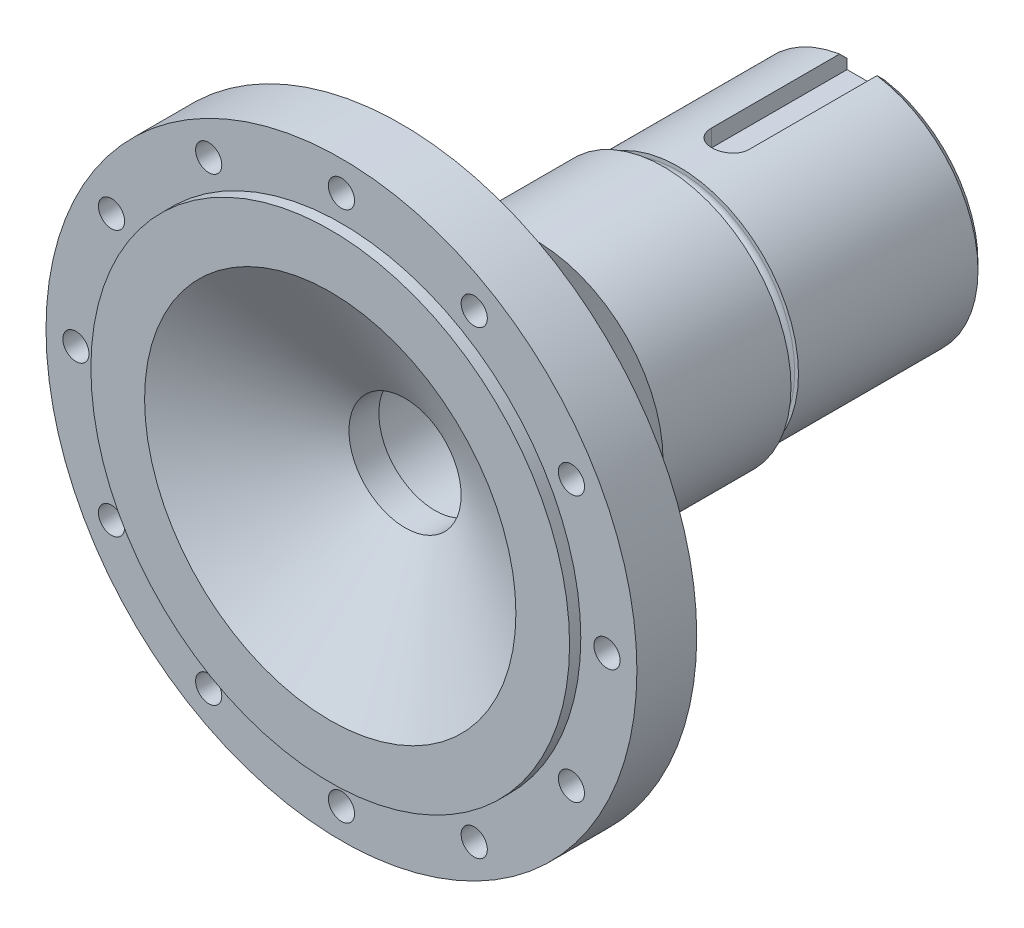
ISO-10303-21;
HEADER;
FILE_DESCRIPTION(('STEP AP214'),'2;1');
FILE_NAME('part.step','',(''),(''),'','','');
FILE_SCHEMA(('AUTOMOTIVE_DESIGN { 1 0 10303 214 1 1 1 1 }'));
ENDSEC;
DATA;
#1=APPLICATION_CONTEXT('core data for automotive mechanical design processes');
#2=APPLICATION_PROTOCOL_DEFINITION('international standard','automotive_design',2000,#1);
#3=PRODUCT_CONTEXT('',#1,'mechanical');
#4=PRODUCT('Part','Part','',(#3));
#5=PRODUCT_RELATED_PRODUCT_CATEGORY('part','',(#4));
#6=PRODUCT_DEFINITION_FORMATION('','',#4);
#7=PRODUCT_DEFINITION_CONTEXT('part definition',#1,'design');
#8=PRODUCT_DEFINITION('design','',#6,#7);
#9=PRODUCT_DEFINITION_SHAPE('','',#8);
#10=(LENGTH_UNIT() NAMED_UNIT(*) SI_UNIT(.MILLI.,.METRE.));
#11=(NAMED_UNIT(*) PLANE_ANGLE_UNIT() SI_UNIT($,.RADIAN.));
#12=(NAMED_UNIT(*) SI_UNIT($,.STERADIAN.) SOLID_ANGLE_UNIT());
#13=UNCERTAINTY_MEASURE_WITH_UNIT(LENGTH_MEASURE(1.E-05),#10,'distance_accuracy_value','');
#14=(GEOMETRIC_REPRESENTATION_CONTEXT(3) GLOBAL_UNCERTAINTY_ASSIGNED_CONTEXT((#13)) GLOBAL_UNIT_ASSIGNED_CONTEXT((#10,
#11,#12)) REPRESENTATION_CONTEXT('',''));
#15=CARTESIAN_POINT('',(0.,0.,0.));
#16=DIRECTION('',(0.,0.,1.));
#17=DIRECTION('',(1.,0.,0.));
#18=AXIS2_PLACEMENT_3D('',#15,#16,#17);
#19=CARTESIAN_POINT('',(0.,7.91257488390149,-72.3224093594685));
#20=DIRECTION('',(0.,0.,1.));
#21=DIRECTION('',(1.,0.,0.));
#22=AXIS2_PLACEMENT_3D('',#19,#20,#21);
#23=PLANE('',#22);
#24=CARTESIAN_POINT('',(0.,0.,-72.3224093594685));
#25=DIRECTION('',(0.,0.,1.));
#26=DIRECTION('',(1.,0.,0.));
#27=AXIS2_PLACEMENT_3D('',#24,#25,#26);
#28=CIRCLE('',#27,12.5101357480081);
#29=CARTESIAN_POINT('',(12.5101357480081,0.,-72.3224093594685));
#30=VERTEX_POINT('',#29);
#31=EDGE_CURVE('E180',#30,#30,#28,.T.);
#32=ORIENTED_EDGE('',*,*,#31,.T.);
#33=EDGE_LOOP('',(#32));
#34=FACE_BOUND('',#33,.T.);
#35=DIRECTION('',(0.,-1.,0.));
#36=VECTOR('',#35,1.);
#37=CARTESIAN_POINT('',(2.50000000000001,7.91257488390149,-72.3224093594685));
#38=LINE('',#37,#36);
#39=CARTESIAN_POINT('',(2.50000000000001,14.7901994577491,-72.3224093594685));
#40=VERTEX_POINT('',#39);
#41=CARTESIAN_POINT('',(2.50000000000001,13.5,-72.3224093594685));
#42=VERTEX_POINT('',#41);
#43=EDGE_CURVE('E106',#40,#42,#38,.T.);
#44=ORIENTED_EDGE('',*,*,#43,.F.);
#45=CARTESIAN_POINT('',(0.,0.,-72.3224093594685));
#46=DIRECTION('',(0.,0.,1.));
#47=DIRECTION('',(1.,0.,0.));
#48=AXIS2_PLACEMENT_3D('',#45,#46,#47);
#49=CIRCLE('',#48,15.);
#50=CARTESIAN_POINT('',(-2.50000000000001,14.7901994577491,-72.3224093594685));
#51=VERTEX_POINT('',#50);
#52=EDGE_CURVE('E53',#40,#51,#49,.F.);
#53=ORIENTED_EDGE('',*,*,#52,.T.);
#54=DIRECTION('',(0.,1.,0.));
#55=VECTOR('',#54,1.);
#56=CARTESIAN_POINT('',(-2.50000000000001,7.91257488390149,-72.3224093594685));
#57=LINE('',#56,#55);
#58=CARTESIAN_POINT('',(-2.50000000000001,13.5,-72.3224093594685));
#59=VERTEX_POINT('',#58);
#60=EDGE_CURVE('E100',#59,#51,#57,.T.);
#61=ORIENTED_EDGE('',*,*,#60,.F.);
#62=DIRECTION('',(-1.,0.,0.));
#63=VECTOR('',#62,1.);
#64=CARTESIAN_POINT('',(0.,13.5,-72.3224093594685));
#65=LINE('',#64,#63);
#66=EDGE_CURVE('E585',#42,#59,#65,.T.);
#67=ORIENTED_EDGE('',*,*,#66,.F.);
#68=EDGE_LOOP('',(#44,#53,#61,#67));
#69=FACE_BOUND('',#68,.T.);
#70=ADVANCED_FACE('F40',(#34,#69),#23,.F.);
#71=CARTESIAN_POINT('',(0.,0.,61.8175968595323));
#72=DIRECTION('',(0.,0.,1.));
#73=DIRECTION('',(1.,0.,0.));
#74=AXIS2_PLACEMENT_3D('',#71,#72,#73);
#75=CYLINDRICAL_SURFACE('',#74,16.);
#76=CARTESIAN_POINT('',(0.,0.,-47.3224093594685));
#77=DIRECTION('',(0.,0.,1.));
#78=DIRECTION('',(1.,0.,0.));
#79=AXIS2_PLACEMENT_3D('',#76,#77,#78);
#80=CIRCLE('',#79,16.);
#81=CARTESIAN_POINT('',(16.,0.,-47.3224093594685));
#82=VERTEX_POINT('',#81);
#83=EDGE_CURVE('E177',#82,#82,#80,.T.);
#84=ORIENTED_EDGE('',*,*,#83,.F.);
#85=EDGE_LOOP('',(#84));
#86=FACE_BOUND('',#85,.T.);
#87=DIRECTION('',(0.,0.,1.));
#88=VECTOR('',#87,1.);
#89=CARTESIAN_POINT('',(-2.5,15.8034806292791,61.8175968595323));
#90=LINE('',#89,#88);
#91=CARTESIAN_POINT('',(-2.50000000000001,15.8034806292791,-54.2224093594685));
#92=VERTEX_POINT('',#91);
#93=CARTESIAN_POINT('',(-2.5,15.8034806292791,-71.3224093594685));
#94=VERTEX_POINT('',#93);
#95=EDGE_CURVE('E228',#92,#94,#90,.F.);
#96=ORIENTED_EDGE('',*,*,#95,.T.);
#97=CARTESIAN_POINT('',(0.,0.,-71.3224093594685));
#98=DIRECTION('',(0.,0.,1.));
#99=DIRECTION('',(1.,0.,0.));
#100=AXIS2_PLACEMENT_3D('',#97,#98,#99);
#101=CIRCLE('',#100,16.);
#102=CARTESIAN_POINT('',(2.49999999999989,15.8034806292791,-71.3224093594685));
#103=VERTEX_POINT('',#102);
#104=EDGE_CURVE('E583',#94,#103,#101,.T.);
#105=ORIENTED_EDGE('',*,*,#104,.T.);
#106=DIRECTION('',(0.,0.,1.));
#107=VECTOR('',#106,1.);
#108=CARTESIAN_POINT('',(2.49999999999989,15.8034806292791,61.8175968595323));
#109=LINE('',#108,#107);
#110=CARTESIAN_POINT('',(2.49999999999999,15.8034806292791,-54.2224093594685));
#111=VERTEX_POINT('',#110);
#112=EDGE_CURVE('E260',#103,#111,#109,.T.);
#113=ORIENTED_EDGE('',*,*,#112,.T.);
#114=CARTESIAN_POINT('',(0.,16.,-56.7224093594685));
#115=CARTESIAN_POINT('',(0.139515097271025,15.9999977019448,-56.722403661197));
#116=CARTESIAN_POINT('',(0.279109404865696,15.9981561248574,-56.7106912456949));
#117=CARTESIAN_POINT('',(0.554391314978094,15.9909869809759,-56.6641656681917));
#118=CARTESIAN_POINT('',(0.690075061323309,15.9856560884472,-56.629330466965));
#119=CARTESIAN_POINT('',(0.953512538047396,15.9721069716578,-56.5376296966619));
#120=CARTESIAN_POINT('',(1.0812723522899,15.9638909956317,-56.4807812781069));
#121=CARTESIAN_POINT('',(1.32542125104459,15.9454779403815,-56.3467108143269));
#122=CARTESIAN_POINT('',(1.4418118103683,15.9352811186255,-56.2694914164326));
#123=CARTESIAN_POINT('',(1.66091991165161,15.9139426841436,-56.0961763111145));
#124=CARTESIAN_POINT('',(1.76352747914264,15.9027945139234,-55.9999423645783));
#125=CARTESIAN_POINT('',(1.95120768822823,15.8808607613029,-55.7916274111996));
#126=CARTESIAN_POINT('',(2.03627928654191,15.8700752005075,-55.6795454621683));
#127=CARTESIAN_POINT('',(2.18690544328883,15.8500242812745,-55.4419710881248));
#128=CARTESIAN_POINT('',(2.25235273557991,15.840767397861,-55.3164098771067));
#129=CARTESIAN_POINT('',(2.36118681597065,15.8249120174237,-55.0559079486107));
#130=CARTESIAN_POINT('',(2.40457491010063,15.8183133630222,-54.9209677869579));
#131=CARTESIAN_POINT('',(2.46771559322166,15.8085863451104,-54.6466984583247));
#132=CARTESIAN_POINT('',(2.48765705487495,15.8054302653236,-54.5074137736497));
#133=CARTESIAN_POINT('',(2.50392369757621,15.8028617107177,-54.2274421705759));
#134=CARTESIAN_POINT('',(2.50025034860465,15.8034490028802,-54.0867553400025));
#135=CARTESIAN_POINT('',(2.46954580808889,15.8082755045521,-53.8093123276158));
#136=CARTESIAN_POINT('',(2.44272562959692,15.8124817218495,-53.6725321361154));
#137=CARTESIAN_POINT('',(2.36681937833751,15.8240205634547,-53.4054373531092));
#138=CARTESIAN_POINT('',(2.31773262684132,15.8313532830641,-53.275122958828));
#139=CARTESIAN_POINT('',(2.19846916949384,15.8483550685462,-53.0240206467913));
#140=CARTESIAN_POINT('',(2.12820372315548,15.8580339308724,-52.9032755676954));
#141=CARTESIAN_POINT('',(1.96864058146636,15.878630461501,-52.675209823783));
#142=CARTESIAN_POINT('',(1.87934153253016,15.8895482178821,-52.567890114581));
#143=CARTESIAN_POINT('',(1.68309088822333,15.911537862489,-52.3684991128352));
#144=CARTESIAN_POINT('',(1.57595800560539,15.9226101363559,-52.276606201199));
#145=CARTESIAN_POINT('',(1.34769694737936,15.9435512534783,-52.1120762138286));
#146=CARTESIAN_POINT('',(1.22656870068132,15.9534200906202,-52.0394392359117));
#147=CARTESIAN_POINT('',(0.973595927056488,15.9708539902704,-51.9154712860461));
#148=CARTESIAN_POINT('',(0.841744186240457,15.9784174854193,-51.8641548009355));
#149=CARTESIAN_POINT('',(0.571149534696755,15.9903756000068,-51.7844433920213));
#150=CARTESIAN_POINT('',(0.432407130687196,15.9947704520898,-51.756046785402));
#151=CARTESIAN_POINT('',(0.15350833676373,15.9998651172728,-51.7232200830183));
#152=CARTESIAN_POINT('',(0.0133814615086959,16.0006027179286,-51.7185448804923));
#153=CARTESIAN_POINT('',(-0.265654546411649,15.9984028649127,-51.7326420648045));
#154=CARTESIAN_POINT('',(-0.404563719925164,15.9954655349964,-51.7514136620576));
#155=CARTESIAN_POINT('',(-0.676473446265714,15.9862692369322,-51.8116677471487));
#156=CARTESIAN_POINT('',(-0.80950126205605,15.9800278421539,-51.8530301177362));
#157=CARTESIAN_POINT('',(-1.06673406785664,15.9649207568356,-51.9571644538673));
#158=CARTESIAN_POINT('',(-1.19093861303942,15.9560549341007,-52.0199374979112));
#159=CARTESIAN_POINT('',(-1.42807220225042,15.9365897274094,-52.1656813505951));
#160=CARTESIAN_POINT('',(-1.54090512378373,15.9259772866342,-52.248806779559));
#161=CARTESIAN_POINT('',(-1.75110696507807,15.9042388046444,-52.4326814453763));
#162=CARTESIAN_POINT('',(-1.84847490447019,15.8931127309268,-52.5334317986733));
#163=CARTESIAN_POINT('',(-2.02588080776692,15.8714802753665,-52.7507905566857));
#164=CARTESIAN_POINT('',(-2.10575398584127,15.860980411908,-52.8675342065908));
#165=CARTESIAN_POINT('',(-2.24475567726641,15.8419069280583,-53.1129254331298));
#166=CARTESIAN_POINT('',(-2.30388478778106,15.83333325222,-53.241572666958));
#167=CARTESIAN_POINT('',(-2.39946771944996,15.8191307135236,-53.5066390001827));
#168=CARTESIAN_POINT('',(-2.43600654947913,15.8134908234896,-53.6430268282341));
#169=CARTESIAN_POINT('',(-2.48564122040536,15.8057657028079,-53.9200985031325));
#170=CARTESIAN_POINT('',(-2.49873883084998,15.8036802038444,-54.0607820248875));
#171=CARTESIAN_POINT('',(-2.50107452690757,15.8033105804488,-54.340808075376));
#172=CARTESIAN_POINT('',(-2.49057180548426,15.804985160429,-54.480148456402));
#173=CARTESIAN_POINT('',(-2.44656223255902,15.8118569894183,-54.7550546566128));
#174=CARTESIAN_POINT('',(-2.41305543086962,15.8170542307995,-54.8906204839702));
#175=CARTESIAN_POINT('',(-2.32408329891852,15.830370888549,-55.154047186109));
#176=CARTESIAN_POINT('',(-2.26863761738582,15.8384876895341,-55.2819148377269));
#177=CARTESIAN_POINT('',(-2.13738768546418,15.856731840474,-55.5265749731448));
#178=CARTESIAN_POINT('',(-2.06158262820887,15.8668592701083,-55.6433670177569));
#179=CARTESIAN_POINT('',(-1.89083008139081,15.8881156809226,-55.8638749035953));
#180=CARTESIAN_POINT('',(-1.79569107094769,15.8992540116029,-55.9674415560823));
#181=CARTESIAN_POINT('',(-1.58937594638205,15.9212004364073,-56.1572305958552));
#182=CARTESIAN_POINT('',(-1.47819612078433,15.9320084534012,-56.2434489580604));
#183=CARTESIAN_POINT('',(-1.24216685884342,15.952151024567,-56.3965605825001));
#184=CARTESIAN_POINT('',(-1.11723937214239,15.9614763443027,-56.4633347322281));
#185=CARTESIAN_POINT('',(-0.857851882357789,15.9775125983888,-56.5748503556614));
#186=CARTESIAN_POINT('',(-0.723401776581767,15.9842262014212,-56.6196143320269));
#187=CARTESIAN_POINT('',(-0.4903142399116,15.9927744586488,-56.6758423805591));
#188=CARTESIAN_POINT('',(-0.393105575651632,15.9954699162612,-56.6932778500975));
#189=CARTESIAN_POINT('',(-0.19727779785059,15.9990834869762,-56.7165632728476));
#190=CARTESIAN_POINT('',(-0.0986587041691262,16.0000016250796,-56.7224133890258));
#191=CARTESIAN_POINT('',(0.,16.,-56.7224093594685));
#192=B_SPLINE_CURVE_WITH_KNOTS('',3,(#114,#115,#116,#117,#118,#119,#120,#121,#122,#123,#124,
#125,#126,#127,#128,#129,#130,#131,#132,#133,#134,#135,#136,#137,#138,#139,#140,#141,#142,#143,
#144,#145,#146,#147,#148,#149,#150,#151,#152,#153,#154,#155,#156,#157,#158,#159,#160,#161,#162,
#163,#164,#165,#166,#167,#168,#169,#170,#171,#172,#173,#174,#175,#176,#177,#178,#179,#180,#181,
#182,#183,#184,#185,#186,#187,#188,#189,#190,#191),.UNSPECIFIED.,.T.,.F.,(4,2,2,2,2,2,2,2,2,2,2,
2,2,2,2,2,2,2,2,2,2,2,2,2,2,2,2,2,2,2,2,2,2,2,2,2,2,2,4),(0.,0.418184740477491,
0.836768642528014,1.25502707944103,1.6732311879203,2.094595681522,2.51598523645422,
2.9396377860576,3.36326525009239,3.78345631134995,4.20362121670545,4.6199957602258,
5.03638299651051,5.45453977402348,5.87272629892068,6.29545732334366,6.71819049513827,
7.14121043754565,7.56419931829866,7.98280854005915,8.40140366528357,8.81779444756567,
9.23420620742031,9.65388541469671,10.0735912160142,10.4970948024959,10.9205861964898,
11.3424741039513,11.764330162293,12.1815758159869,12.598820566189,13.0156924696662,
13.4325808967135,13.8538201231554,14.275156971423,14.6990230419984,15.1224548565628,
15.4181801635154,15.7139013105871),.UNSPECIFIED.);
#193=EDGE_CURVE('E99',#111,#92,#192,.T.);
#194=ORIENTED_EDGE('',*,*,#193,.T.);
#195=EDGE_LOOP('',(#96,#105,#113,#194));
#196=FACE_BOUND('',#195,.T.);
#197=ADVANCED_FACE('F262',(#86,#196),#75,.T.);
#198=CARTESIAN_POINT('',(0.,0.,61.8175968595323));
#199=DIRECTION('',(0.,0.,1.));
#200=DIRECTION('',(1.,0.,0.));
#201=AXIS2_PLACEMENT_3D('',#198,#199,#200);
#202=CYLINDRICAL_SURFACE('',#201,17.);
#203=CARTESIAN_POINT('',(0.,0.,-45.3224093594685));
#204=DIRECTION('',(0.,0.,1.));
#205=DIRECTION('',(1.,0.,0.));
#206=AXIS2_PLACEMENT_3D('',#203,#204,#205);
#207=CIRCLE('',#206,17.);
#208=CARTESIAN_POINT('',(17.,0.,-45.3224093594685));
#209=VERTEX_POINT('',#208);
#210=EDGE_CURVE('E168',#209,#209,#207,.T.);
#211=ORIENTED_EDGE('',*,*,#210,.T.);
#212=EDGE_LOOP('',(#211));
#213=FACE_BOUND('',#212,.T.);
#214=CARTESIAN_POINT('',(0.,0.,-28.2224093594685));
#215=DIRECTION('',(0.,0.,1.));
#216=DIRECTION('',(1.,0.,0.));
#217=AXIS2_PLACEMENT_3D('',#214,#215,#216);
#218=CIRCLE('',#217,17.);
#219=CARTESIAN_POINT('',(17.,0.,-28.2224093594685));
#220=VERTEX_POINT('',#219);
#221=EDGE_CURVE('E225',#220,#220,#218,.T.);
#222=ORIENTED_EDGE('',*,*,#221,.F.);
#223=EDGE_LOOP('',(#222));
#224=FACE_BOUND('',#223,.T.);
#225=ADVANCED_FACE('F42',(#213,#224),#202,.T.);
#226=CARTESIAN_POINT('',(0.,0.,-16.7224093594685));
#227=DIRECTION('',(0.,0.,1.));
#228=DIRECTION('',(1.,0.,0.));
#229=AXIS2_PLACEMENT_3D('',#226,#227,#228);
#230=CONICAL_SURFACE('',#229,26.6496457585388,0.698131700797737);
#231=ORIENTED_EDGE('',*,*,#221,.T.);
#232=EDGE_LOOP('',(#231));
#233=FACE_BOUND('',#232,.T.);
#234=CARTESIAN_POINT('',(0.,0.,-16.7224093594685));
#235=DIRECTION('',(0.,0.,1.));
#236=DIRECTION('',(1.,0.,0.));
#237=AXIS2_PLACEMENT_3D('',#234,#235,#236);
#238=CIRCLE('',#237,26.6496457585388);
#239=CARTESIAN_POINT('',(26.6496457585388,0.,-16.7224093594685));
#240=VERTEX_POINT('',#239);
#241=EDGE_CURVE('E222',#240,#240,#238,.T.);
#242=ORIENTED_EDGE('',*,*,#241,.F.);
#243=EDGE_LOOP('',(#242));
#244=FACE_BOUND('',#243,.T.);
#245=ADVANCED_FACE('F395',(#233,#244),#230,.T.);
#246=CARTESIAN_POINT('',(0.,7.91257488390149,-16.7224093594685));
#247=DIRECTION('',(0.,0.,1.));
#248=DIRECTION('',(1.,0.,0.));
#249=AXIS2_PLACEMENT_3D('',#246,#247,#248);
#250=PLANE('',#249);
#251=CARTESIAN_POINT('',(0.,0.,-16.7224093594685));
#252=DIRECTION('',(0.,0.,1.));
#253=DIRECTION('',(1.,0.,0.));
#254=AXIS2_PLACEMENT_3D('',#251,#252,#253);
#255=CIRCLE('',#254,28.);
#256=CARTESIAN_POINT('',(28.,0.,-16.7224093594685));
#257=VERTEX_POINT('',#256);
#258=EDGE_CURVE('E219',#257,#257,#255,.T.);
#259=ORIENTED_EDGE('',*,*,#258,.F.);
#260=EDGE_LOOP('',(#259));
#261=FACE_BOUND('',#260,.T.);
#262=ORIENTED_EDGE('',*,*,#241,.T.);
#263=EDGE_LOOP('',(#262));
#264=FACE_BOUND('',#263,.T.);
#265=ADVANCED_FACE('F392',(#261,#264),#250,.F.);
#266=CARTESIAN_POINT('',(0.,0.,61.8175968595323));
#267=DIRECTION('',(0.,0.,1.));
#268=DIRECTION('',(1.,0.,0.));
#269=AXIS2_PLACEMENT_3D('',#266,#267,#268);
#270=CYLINDRICAL_SURFACE('',#269,28.);
#271=ORIENTED_EDGE('',*,*,#258,.T.);
#272=EDGE_LOOP('',(#271));
#273=FACE_BOUND('',#272,.T.);
#274=CARTESIAN_POINT('',(0.,0.,-10.2224093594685));
#275=DIRECTION('',(0.,0.,1.));
#276=DIRECTION('',(1.,0.,0.));
#277=AXIS2_PLACEMENT_3D('',#274,#275,#276);
#278=CIRCLE('',#277,28.);
#279=CARTESIAN_POINT('',(28.,0.,-10.2224093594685));
#280=VERTEX_POINT('',#279);
#281=EDGE_CURVE('E216',#280,#280,#278,.T.);
#282=ORIENTED_EDGE('',*,*,#281,.F.);
#283=EDGE_LOOP('',(#282));
#284=FACE_BOUND('',#283,.T.);
#285=ADVANCED_FACE('F388',(#273,#284),#270,.T.);
#286=CARTESIAN_POINT('',(0.,7.91257488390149,-10.2224093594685));
#287=DIRECTION('',(0.,0.,1.));
#288=DIRECTION('',(1.,0.,0.));
#289=AXIS2_PLACEMENT_3D('',#286,#287,#288);
#290=PLANE('',#289);
#291=CARTESIAN_POINT('',(17.7499999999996,30.7439018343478,-10.2224093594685));
#292=DIRECTION('',(0.,0.,1.));
#293=DIRECTION('',(1.,0.,0.));
#294=AXIS2_PLACEMENT_3D('',#291,#292,#293);
#295=CIRCLE('',#294,1.75);
#296=CARTESIAN_POINT('',(19.4999999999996,30.7439018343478,-10.2224093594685));
#297=VERTEX_POINT('',#296);
#298=EDGE_CURVE('E121',#297,#297,#295,.T.);
#299=ORIENTED_EDGE('',*,*,#298,.T.);
#300=EDGE_LOOP('',(#299));
#301=FACE_BOUND('',#300,.T.);
#302=CARTESIAN_POINT('',(30.7439018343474,17.7500000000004,-10.2224093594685));
#303=DIRECTION('',(0.,0.,1.));
#304=DIRECTION('',(1.,0.,0.));
#305=AXIS2_PLACEMENT_3D('',#302,#303,#304);
#306=CIRCLE('',#305,1.75);
#307=CARTESIAN_POINT('',(32.4939018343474,17.7500000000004,-10.2224093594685));
#308=VERTEX_POINT('',#307);
#309=EDGE_CURVE('E125',#308,#308,#306,.T.);
#310=ORIENTED_EDGE('',*,*,#309,.T.);
#311=EDGE_LOOP('',(#310));
#312=FACE_BOUND('',#311,.T.);
#313=CARTESIAN_POINT('',(35.5,3.71842977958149E-13,-10.2224093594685));
#314=DIRECTION('',(0.,0.,1.));
#315=DIRECTION('',(1.,0.,0.));
#316=AXIS2_PLACEMENT_3D('',#313,#314,#315);
#317=CIRCLE('',#316,1.75);
#318=CARTESIAN_POINT('',(37.25,3.71842977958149E-13,-10.2224093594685));
#319=VERTEX_POINT('',#318);
#320=EDGE_CURVE('E129',#319,#319,#317,.T.);
#321=ORIENTED_EDGE('',*,*,#320,.T.);
#322=EDGE_LOOP('',(#321));
#323=FACE_BOUND('',#322,.T.);
#324=CARTESIAN_POINT('',(30.7439018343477,-17.7499999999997,-10.2224093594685));
#325=DIRECTION('',(0.,0.,1.));
#326=DIRECTION('',(1.,0.,0.));
#327=AXIS2_PLACEMENT_3D('',#324,#325,#326);
#328=CIRCLE('',#327,1.75);
#329=CARTESIAN_POINT('',(32.4939018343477,-17.7499999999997,-10.2224093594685));
#330=VERTEX_POINT('',#329);
#331=EDGE_CURVE('E133',#330,#330,#328,.T.);
#332=ORIENTED_EDGE('',*,*,#331,.T.);
#333=EDGE_LOOP('',(#332));
#334=FACE_BOUND('',#333,.T.);
#335=CARTESIAN_POINT('',(17.7500000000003,-30.7439018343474,-10.2224093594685));
#336=DIRECTION('',(0.,0.,1.));
#337=DIRECTION('',(1.,0.,0.));
#338=AXIS2_PLACEMENT_3D('',#335,#336,#337);
#339=CIRCLE('',#338,1.75);
#340=CARTESIAN_POINT('',(19.5000000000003,-30.7439018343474,-10.2224093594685));
#341=VERTEX_POINT('',#340);
#342=EDGE_CURVE('E137',#341,#341,#339,.T.);
#343=ORIENTED_EDGE('',*,*,#342,.T.);
#344=EDGE_LOOP('',(#343));
#345=FACE_BOUND('',#344,.T.);
#346=CARTESIAN_POINT('',(2.47895318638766E-13,-35.5,-10.2224093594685));
#347=DIRECTION('',(0.,0.,1.));
#348=DIRECTION('',(1.,0.,0.));
#349=AXIS2_PLACEMENT_3D('',#346,#347,#348);
#350=CIRCLE('',#349,1.75);
#351=CARTESIAN_POINT('',(1.75000000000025,-35.5,-10.2224093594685));
#352=VERTEX_POINT('',#351);
#353=EDGE_CURVE('E141',#352,#352,#350,.T.);
#354=ORIENTED_EDGE('',*,*,#353,.T.);
#355=EDGE_LOOP('',(#354));
#356=FACE_BOUND('',#355,.T.);
#357=CARTESIAN_POINT('',(-17.7499999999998,-30.7439018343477,-10.2224093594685));
#358=DIRECTION('',(0.,0.,1.));
#359=DIRECTION('',(1.,0.,0.));
#360=AXIS2_PLACEMENT_3D('',#357,#358,#359);
#361=CIRCLE('',#360,1.75);
#362=CARTESIAN_POINT('',(-15.9999999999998,-30.7439018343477,-10.2224093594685));
#363=VERTEX_POINT('',#362);
#364=EDGE_CURVE('E145',#363,#363,#361,.T.);
#365=ORIENTED_EDGE('',*,*,#364,.T.);
#366=EDGE_LOOP('',(#365));
#367=FACE_BOUND('',#366,.T.);
#368=CARTESIAN_POINT('',(-30.7439018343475,-17.7500000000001,-10.2224093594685));
#369=DIRECTION('',(0.,0.,1.));
#370=DIRECTION('',(1.,0.,0.));
#371=AXIS2_PLACEMENT_3D('',#368,#369,#370);
#372=CIRCLE('',#371,1.75);
#373=CARTESIAN_POINT('',(-28.9939018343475,-17.7500000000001,-10.2224093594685));
#374=VERTEX_POINT('',#373);
#375=EDGE_CURVE('E149',#374,#374,#372,.T.);
#376=ORIENTED_EDGE('',*,*,#375,.T.);
#377=EDGE_LOOP('',(#376));
#378=FACE_BOUND('',#377,.T.);
#379=CARTESIAN_POINT('',(-35.5,-1.23947659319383E-13,-10.2224093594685));
#380=DIRECTION('',(0.,0.,1.));
#381=DIRECTION('',(1.,0.,0.));
#382=AXIS2_PLACEMENT_3D('',#379,#380,#381);
#383=CIRCLE('',#382,1.75);
#384=CARTESIAN_POINT('',(-33.75,-1.23947659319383E-13,-10.2224093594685));
#385=VERTEX_POINT('',#384);
#386=EDGE_CURVE('E153',#385,#385,#383,.T.);
#387=ORIENTED_EDGE('',*,*,#386,.T.);
#388=EDGE_LOOP('',(#387));
#389=FACE_BOUND('',#388,.T.);
#390=CARTESIAN_POINT('',(-30.7439018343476,17.7499999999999,-10.2224093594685));
#391=DIRECTION('',(0.,0.,1.));
#392=DIRECTION('',(1.,0.,0.));
#393=AXIS2_PLACEMENT_3D('',#390,#391,#392);
#394=CIRCLE('',#393,1.75);
#395=CARTESIAN_POINT('',(-28.9939018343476,17.7499999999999,-10.2224093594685));
#396=VERTEX_POINT('',#395);
#397=EDGE_CURVE('E157',#396,#396,#394,.T.);
#398=ORIENTED_EDGE('',*,*,#397,.T.);
#399=EDGE_LOOP('',(#398));
#400=FACE_BOUND('',#399,.T.);
#401=CARTESIAN_POINT('',(-17.75,30.7439018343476,-10.2224093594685));
#402=DIRECTION('',(0.,0.,1.));
#403=DIRECTION('',(1.,0.,0.));
#404=AXIS2_PLACEMENT_3D('',#401,#402,#403);
#405=CIRCLE('',#404,1.75);
#406=CARTESIAN_POINT('',(-16.,30.7439018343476,-10.2224093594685));
#407=VERTEX_POINT('',#406);
#408=EDGE_CURVE('E161',#407,#407,#405,.T.);
#409=ORIENTED_EDGE('',*,*,#408,.T.);
#410=EDGE_LOOP('',(#409));
#411=FACE_BOUND('',#410,.T.);
#412=CARTESIAN_POINT('',(0.,35.5,-10.2224093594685));
#413=DIRECTION('',(0.,0.,1.));
#414=DIRECTION('',(1.,0.,0.));
#415=AXIS2_PLACEMENT_3D('',#412,#413,#414);
#416=CIRCLE('',#415,1.75);
#417=CARTESIAN_POINT('',(1.75,35.5,-10.2224093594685));
#418=VERTEX_POINT('',#417);
#419=EDGE_CURVE('E165',#418,#418,#416,.T.);
#420=ORIENTED_EDGE('',*,*,#419,.T.);
#421=EDGE_LOOP('',(#420));
#422=FACE_BOUND('',#421,.T.);
#423=CARTESIAN_POINT('',(0.,0.,-10.2224093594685));
#424=DIRECTION('',(0.,0.,1.));
#425=DIRECTION('',(1.,0.,0.));
#426=AXIS2_PLACEMENT_3D('',#423,#424,#425);
#427=CIRCLE('',#426,39.5);
#428=CARTESIAN_POINT('',(39.5,0.,-10.2224093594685));
#429=VERTEX_POINT('',#428);
#430=EDGE_CURVE('E213',#429,#429,#427,.T.);
#431=ORIENTED_EDGE('',*,*,#430,.F.);
#432=EDGE_LOOP('',(#431));
#433=FACE_BOUND('',#432,.T.);
#434=ORIENTED_EDGE('',*,*,#281,.T.);
#435=EDGE_LOOP('',(#434));
#436=FACE_BOUND('',#435,.T.);
#437=ADVANCED_FACE('F384',(#301,#312,#323,#334,#345,#356,#367,#378,#389,#400,#411,#422,#433,
#436),#290,.F.);
#438=CARTESIAN_POINT('',(0.,0.,61.8175968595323));
#439=DIRECTION('',(0.,0.,1.));
#440=DIRECTION('',(1.,0.,0.));
#441=AXIS2_PLACEMENT_3D('',#438,#439,#440);
#442=CYLINDRICAL_SURFACE('',#441,39.5);
#443=ORIENTED_EDGE('',*,*,#430,.T.);
#444=EDGE_LOOP('',(#443));
#445=FACE_BOUND('',#444,.T.);
#446=CARTESIAN_POINT('',(0.,0.,-2.22240935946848));
#447=DIRECTION('',(0.,0.,1.));
#448=DIRECTION('',(1.,0.,0.));
#449=AXIS2_PLACEMENT_3D('',#446,#447,#448);
#450=CIRCLE('',#449,39.5);
#451=CARTESIAN_POINT('',(39.5,0.,-2.22240935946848));
#452=VERTEX_POINT('',#451);
#453=EDGE_CURVE('E210',#452,#452,#450,.T.);
#454=ORIENTED_EDGE('',*,*,#453,.F.);
#455=EDGE_LOOP('',(#454));
#456=FACE_BOUND('',#455,.T.);
#457=ADVANCED_FACE('F380',(#445,#456),#442,.T.);
#458=CARTESIAN_POINT('',(0.,7.91257488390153,-2.22240935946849));
#459=DIRECTION('',(0.,0.,1.));
#460=DIRECTION('',(1.,0.,0.));
#461=AXIS2_PLACEMENT_3D('',#458,#459,#460);
#462=PLANE('',#461);
#463=CARTESIAN_POINT('',(17.7499999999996,30.7439018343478,-2.22240935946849));
#464=DIRECTION('',(0.,0.,1.));
#465=DIRECTION('',(1.,0.,0.));
#466=AXIS2_PLACEMENT_3D('',#463,#464,#465);
#467=CIRCLE('',#466,1.75);
#468=CARTESIAN_POINT('',(19.4999999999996,30.7439018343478,-2.22240935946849));
#469=VERTEX_POINT('',#468);
#470=EDGE_CURVE('E120',#469,#469,#467,.T.);
#471=ORIENTED_EDGE('',*,*,#470,.F.);
#472=EDGE_LOOP('',(#471));
#473=FACE_BOUND('',#472,.T.);
#474=CARTESIAN_POINT('',(30.7439018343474,17.7500000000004,-2.22240935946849));
#475=DIRECTION('',(0.,0.,1.));
#476=DIRECTION('',(1.,0.,0.));
#477=AXIS2_PLACEMENT_3D('',#474,#475,#476);
#478=CIRCLE('',#477,1.75);
#479=CARTESIAN_POINT('',(32.4939018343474,17.7500000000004,-2.22240935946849));
#480=VERTEX_POINT('',#479);
#481=EDGE_CURVE('E124',#480,#480,#478,.T.);
#482=ORIENTED_EDGE('',*,*,#481,.F.);
#483=EDGE_LOOP('',(#482));
#484=FACE_BOUND('',#483,.T.);
#485=CARTESIAN_POINT('',(35.5,3.71842977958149E-13,-2.22240935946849));
#486=DIRECTION('',(0.,0.,1.));
#487=DIRECTION('',(1.,0.,0.));
#488=AXIS2_PLACEMENT_3D('',#485,#486,#487);
#489=CIRCLE('',#488,1.75);
#490=CARTESIAN_POINT('',(37.25,3.71842977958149E-13,-2.22240935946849));
#491=VERTEX_POINT('',#490);
#492=EDGE_CURVE('E128',#491,#491,#489,.T.);
#493=ORIENTED_EDGE('',*,*,#492,.F.);
#494=EDGE_LOOP('',(#493));
#495=FACE_BOUND('',#494,.T.);
#496=CARTESIAN_POINT('',(30.7439018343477,-17.7499999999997,-2.22240935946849));
#497=DIRECTION('',(0.,0.,1.));
#498=DIRECTION('',(1.,0.,0.));
#499=AXIS2_PLACEMENT_3D('',#496,#497,#498);
#500=CIRCLE('',#499,1.75);
#501=CARTESIAN_POINT('',(32.4939018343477,-17.7499999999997,-2.22240935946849));
#502=VERTEX_POINT('',#501);
#503=EDGE_CURVE('E132',#502,#502,#500,.T.);
#504=ORIENTED_EDGE('',*,*,#503,.F.);
#505=EDGE_LOOP('',(#504));
#506=FACE_BOUND('',#505,.T.);
#507=CARTESIAN_POINT('',(17.7500000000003,-30.7439018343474,-2.22240935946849));
#508=DIRECTION('',(0.,0.,1.));
#509=DIRECTION('',(1.,0.,0.));
#510=AXIS2_PLACEMENT_3D('',#507,#508,#509);
#511=CIRCLE('',#510,1.75);
#512=CARTESIAN_POINT('',(19.5000000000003,-30.7439018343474,-2.22240935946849));
#513=VERTEX_POINT('',#512);
#514=EDGE_CURVE('E136',#513,#513,#511,.T.);
#515=ORIENTED_EDGE('',*,*,#514,.F.);
#516=EDGE_LOOP('',(#515));
#517=FACE_BOUND('',#516,.T.);
#518=CARTESIAN_POINT('',(2.47895318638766E-13,-35.5,-2.22240935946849));
#519=DIRECTION('',(0.,0.,1.));
#520=DIRECTION('',(1.,0.,0.));
#521=AXIS2_PLACEMENT_3D('',#518,#519,#520);
#522=CIRCLE('',#521,1.75);
#523=CARTESIAN_POINT('',(1.75000000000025,-35.5,-2.22240935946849));
#524=VERTEX_POINT('',#523);
#525=EDGE_CURVE('E140',#524,#524,#522,.T.);
#526=ORIENTED_EDGE('',*,*,#525,.F.);
#527=EDGE_LOOP('',(#526));
#528=FACE_BOUND('',#527,.T.);
#529=CARTESIAN_POINT('',(-17.7499999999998,-30.7439018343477,-2.22240935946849));
#530=DIRECTION('',(0.,0.,1.));
#531=DIRECTION('',(1.,0.,0.));
#532=AXIS2_PLACEMENT_3D('',#529,#530,#531);
#533=CIRCLE('',#532,1.75);
#534=CARTESIAN_POINT('',(-15.9999999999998,-30.7439018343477,-2.22240935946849));
#535=VERTEX_POINT('',#534);
#536=EDGE_CURVE('E144',#535,#535,#533,.T.);
#537=ORIENTED_EDGE('',*,*,#536,.F.);
#538=EDGE_LOOP('',(#537));
#539=FACE_BOUND('',#538,.T.);
#540=CARTESIAN_POINT('',(-30.7439018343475,-17.7500000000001,-2.22240935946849));
#541=DIRECTION('',(0.,0.,1.));
#542=DIRECTION('',(1.,0.,0.));
#543=AXIS2_PLACEMENT_3D('',#540,#541,#542);
#544=CIRCLE('',#543,1.75);
#545=CARTESIAN_POINT('',(-28.9939018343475,-17.7500000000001,-2.22240935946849));
#546=VERTEX_POINT('',#545);
#547=EDGE_CURVE('E148',#546,#546,#544,.T.);
#548=ORIENTED_EDGE('',*,*,#547,.F.);
#549=EDGE_LOOP('',(#548));
#550=FACE_BOUND('',#549,.T.);
#551=CARTESIAN_POINT('',(-35.5,-1.23947659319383E-13,-2.22240935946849));
#552=DIRECTION('',(0.,0.,1.));
#553=DIRECTION('',(1.,0.,0.));
#554=AXIS2_PLACEMENT_3D('',#551,#552,#553);
#555=CIRCLE('',#554,1.75);
#556=CARTESIAN_POINT('',(-33.75,-1.23947659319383E-13,-2.22240935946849));
#557=VERTEX_POINT('',#556);
#558=EDGE_CURVE('E152',#557,#557,#555,.T.);
#559=ORIENTED_EDGE('',*,*,#558,.F.);
#560=EDGE_LOOP('',(#559));
#561=FACE_BOUND('',#560,.T.);
#562=CARTESIAN_POINT('',(-30.7439018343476,17.7499999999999,-2.22240935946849));
#563=DIRECTION('',(0.,0.,1.));
#564=DIRECTION('',(1.,0.,0.));
#565=AXIS2_PLACEMENT_3D('',#562,#563,#564);
#566=CIRCLE('',#565,1.75);
#567=CARTESIAN_POINT('',(-28.9939018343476,17.7499999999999,-2.22240935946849));
#568=VERTEX_POINT('',#567);
#569=EDGE_CURVE('E156',#568,#568,#566,.T.);
#570=ORIENTED_EDGE('',*,*,#569,.F.);
#571=EDGE_LOOP('',(#570));
#572=FACE_BOUND('',#571,.T.);
#573=CARTESIAN_POINT('',(-17.75,30.7439018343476,-2.22240935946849));
#574=DIRECTION('',(0.,0.,1.));
#575=DIRECTION('',(1.,0.,0.));
#576=AXIS2_PLACEMENT_3D('',#573,#574,#575);
#577=CIRCLE('',#576,1.75);
#578=CARTESIAN_POINT('',(-16.,30.7439018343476,-2.22240935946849));
#579=VERTEX_POINT('',#578);
#580=EDGE_CURVE('E160',#579,#579,#577,.T.);
#581=ORIENTED_EDGE('',*,*,#580,.F.);
#582=EDGE_LOOP('',(#581));
#583=FACE_BOUND('',#582,.T.);
#584=CARTESIAN_POINT('',(0.,35.5,-2.22240935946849));
#585=DIRECTION('',(0.,0.,1.));
#586=DIRECTION('',(1.,0.,0.));
#587=AXIS2_PLACEMENT_3D('',#584,#585,#586);
#588=CIRCLE('',#587,1.75);
#589=CARTESIAN_POINT('',(1.75,35.5,-2.22240935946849));
#590=VERTEX_POINT('',#589);
#591=EDGE_CURVE('E164',#590,#590,#588,.T.);
#592=ORIENTED_EDGE('',*,*,#591,.F.);
#593=EDGE_LOOP('',(#592));
#594=FACE_BOUND('',#593,.T.);
#595=ORIENTED_EDGE('',*,*,#453,.T.);
#596=EDGE_LOOP('',(#595));
#597=FACE_BOUND('',#596,.T.);
#598=CARTESIAN_POINT('',(0.,0.,-2.22240935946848));
#599=DIRECTION('',(0.,0.,1.));
#600=DIRECTION('',(1.,0.,0.));
#601=AXIS2_PLACEMENT_3D('',#598,#599,#600);
#602=CIRCLE('',#601,32.);
#603=CARTESIAN_POINT('',(32.,0.,-2.22240935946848));
#604=VERTEX_POINT('',#603);
#605=EDGE_CURVE('E207',#604,#604,#602,.T.);
#606=ORIENTED_EDGE('',*,*,#605,.F.);
#607=EDGE_LOOP('',(#606));
#608=FACE_BOUND('',#607,.T.);
#609=ADVANCED_FACE('F376',(#473,#484,#495,#506,#517,#528,#539,#550,#561,#572,#583,#594,#597,
#608),#462,.T.);
#610=CARTESIAN_POINT('',(0.,0.,61.8175968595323));
#611=DIRECTION('',(0.,0.,1.));
#612=DIRECTION('',(1.,0.,0.));
#613=AXIS2_PLACEMENT_3D('',#610,#611,#612);
#614=CYLINDRICAL_SURFACE('',#613,32.);
#615=CARTESIAN_POINT('',(0.,0.,-0.722409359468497));
#616=DIRECTION('',(0.,0.,1.));
#617=DIRECTION('',(1.,0.,0.));
#618=AXIS2_PLACEMENT_3D('',#615,#616,#617);
#619=CIRCLE('',#618,32.);
#620=CARTESIAN_POINT('',(32.,0.,-0.722409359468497));
#621=VERTEX_POINT('',#620);
#622=EDGE_CURVE('E204',#621,#621,#619,.T.);
#623=ORIENTED_EDGE('',*,*,#622,.F.);
#624=EDGE_LOOP('',(#623));
#625=FACE_BOUND('',#624,.T.);
#626=ORIENTED_EDGE('',*,*,#605,.T.);
#627=EDGE_LOOP('',(#626));
#628=FACE_BOUND('',#627,.T.);
#629=ADVANCED_FACE('F372',(#625,#628),#614,.T.);
#630=CARTESIAN_POINT('',(0.,7.91257488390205,-0.722409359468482));
#631=DIRECTION('',(0.,0.,-1.));
#632=DIRECTION('',(-1.,0.,0.));
#633=AXIS2_PLACEMENT_3D('',#630,#631,#632);
#634=PLANE('',#633);
#635=CARTESIAN_POINT('',(0.,0.,-0.722409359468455));
#636=DIRECTION('',(0.,0.,1.));
#637=DIRECTION('',(1.,0.,0.));
#638=AXIS2_PLACEMENT_3D('',#635,#636,#637);
#639=CIRCLE('',#638,24.8205080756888);
#640=CARTESIAN_POINT('',(24.8205080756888,0.,-0.722409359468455));
#641=VERTEX_POINT('',#640);
#642=EDGE_CURVE('E201',#641,#641,#639,.T.);
#643=ORIENTED_EDGE('',*,*,#642,.F.);
#644=EDGE_LOOP('',(#643));
#645=FACE_BOUND('',#644,.T.);
#646=ORIENTED_EDGE('',*,*,#622,.T.);
#647=EDGE_LOOP('',(#646));
#648=FACE_BOUND('',#647,.T.);
#649=ADVANCED_FACE('F368',(#645,#648),#634,.F.);
#650=CARTESIAN_POINT('',(0.,0.,-0.722409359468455));
#651=DIRECTION('',(0.,0.,1.));
#652=DIRECTION('',(1.,0.,0.));
#653=AXIS2_PLACEMENT_3D('',#650,#651,#652);
#654=CONICAL_SURFACE('',#653,24.8205080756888,1.0471975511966);
#655=CARTESIAN_POINT('',(0.,0.,-10.7224093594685));
#656=DIRECTION('',(0.,0.,1.));
#657=DIRECTION('',(1.,0.,0.));
#658=AXIS2_PLACEMENT_3D('',#655,#656,#657);
#659=CIRCLE('',#658,7.50000000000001);
#660=CARTESIAN_POINT('',(7.50000000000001,0.,-10.7224093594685));
#661=VERTEX_POINT('',#660);
#662=EDGE_CURVE('E198',#661,#661,#659,.T.);
#663=CARTESIAN_POINT('',(7.50000000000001,0.,-10.7224093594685));
#664=CARTESIAN_POINT('',(7.68042195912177,0.,-10.6182426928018));
#665=CARTESIAN_POINT('',(7.86084391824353,0.,-10.5140760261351));
#666=CARTESIAN_POINT('',(8.22168783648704,0.,-10.3057426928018));
#667=CARTESIAN_POINT('',(8.4021097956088,0.,-10.2015760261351));
#668=CARTESIAN_POINT('',(8.76295371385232,0.,-9.99324269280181));
#669=CARTESIAN_POINT('',(8.94337567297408,0.,-9.88907602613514));
#670=CARTESIAN_POINT('',(9.3042195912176,0.,-9.68074269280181));
#671=CARTESIAN_POINT('',(9.48464155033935,0.,-9.57657602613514));
#672=CARTESIAN_POINT('',(9.84548546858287,0.,-9.36824269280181));
#673=CARTESIAN_POINT('',(10.0259074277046,0.,-9.26407602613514));
#674=CARTESIAN_POINT('',(10.3867513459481,0.,-9.05574269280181));
#675=CARTESIAN_POINT('',(10.5671733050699,0.,-8.95157602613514));
#676=CARTESIAN_POINT('',(10.9280172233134,0.,-8.74324269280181));
#677=CARTESIAN_POINT('',(11.1084391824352,0.,-8.63907602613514));
#678=CARTESIAN_POINT('',(11.4692831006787,0.,-8.43074269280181));
#679=CARTESIAN_POINT('',(11.6497050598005,0.,-8.32657602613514));
#680=CARTESIAN_POINT('',(12.010548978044,0.,-8.11824269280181));
#681=CARTESIAN_POINT('',(12.1909709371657,0.,-8.01407602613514));
#682=CARTESIAN_POINT('',(12.5518148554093,0.,-7.8057426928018));
#683=CARTESIAN_POINT('',(12.732236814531,0.,-7.70157602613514));
#684=CARTESIAN_POINT('',(13.0930807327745,0.,-7.4932426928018));
#685=CARTESIAN_POINT('',(13.2735026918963,0.,-7.38907602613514));
#686=CARTESIAN_POINT('',(13.6343466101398,0.,-7.1807426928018));
#687=CARTESIAN_POINT('',(13.8147685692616,0.,-7.07657602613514));
#688=CARTESIAN_POINT('',(14.1756124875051,0.,-6.8682426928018));
#689=CARTESIAN_POINT('',(14.3560344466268,0.,-6.76407602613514));
#690=CARTESIAN_POINT('',(14.7168783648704,0.,-6.5557426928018));
#691=CARTESIAN_POINT('',(14.8973003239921,0.,-6.45157602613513));
#692=CARTESIAN_POINT('',(15.2581442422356,0.,-6.2432426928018));
#693=CARTESIAN_POINT('',(15.4385662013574,0.,-6.13907602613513));
#694=CARTESIAN_POINT('',(15.7994101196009,0.,-5.9307426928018));
#695=CARTESIAN_POINT('',(15.9798320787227,0.,-5.82657602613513));
#696=CARTESIAN_POINT('',(16.3406759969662,0.,-5.6182426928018));
#697=CARTESIAN_POINT('',(16.5210979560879,0.,-5.51407602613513));
#698=CARTESIAN_POINT('',(16.8819418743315,0.,-5.3057426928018));
#699=CARTESIAN_POINT('',(17.0623638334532,0.,-5.20157602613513));
#700=CARTESIAN_POINT('',(17.4232077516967,0.,-4.9932426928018));
#701=CARTESIAN_POINT('',(17.6036297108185,0.,-4.88907602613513));
#702=CARTESIAN_POINT('',(17.964473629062,0.,-4.6807426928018));
#703=CARTESIAN_POINT('',(18.1448955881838,0.,-4.57657602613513));
#704=CARTESIAN_POINT('',(18.5057395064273,0.,-4.3682426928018));
#705=CARTESIAN_POINT('',(18.6861614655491,0.,-4.26407602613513));
#706=CARTESIAN_POINT('',(19.0470053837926,0.,-4.0557426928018));
#707=CARTESIAN_POINT('',(19.2274273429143,0.,-3.95157602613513));
#708=CARTESIAN_POINT('',(19.5882712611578,0.,-3.7432426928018));
#709=CARTESIAN_POINT('',(19.7686932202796,0.,-3.63907602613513));
#710=CARTESIAN_POINT('',(20.1295371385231,0.,-3.43074269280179));
#711=CARTESIAN_POINT('',(20.3099590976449,0.,-3.32657602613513));
#712=CARTESIAN_POINT('',(20.6708030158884,0.,-3.11824269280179));
#713=CARTESIAN_POINT('',(20.8512249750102,0.,-3.01407602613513));
#714=CARTESIAN_POINT('',(21.2120688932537,0.,-2.80574269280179));
#715=CARTESIAN_POINT('',(21.3924908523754,0.,-2.70157602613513));
#716=CARTESIAN_POINT('',(21.7533347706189,0.,-2.49324269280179));
#717=CARTESIAN_POINT('',(21.9337567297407,0.,-2.38907602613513));
#718=CARTESIAN_POINT('',(22.2946006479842,0.,-2.18074269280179));
#719=CARTESIAN_POINT('',(22.475022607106,0.,-2.07657602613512));
#720=CARTESIAN_POINT('',(22.8358665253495,0.,-1.86824269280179));
#721=CARTESIAN_POINT('',(23.0162884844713,0.,-1.76407602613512));
#722=CARTESIAN_POINT('',(23.3771324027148,0.,-1.55574269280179));
#723=CARTESIAN_POINT('',(23.5575543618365,0.,-1.45157602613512));
#724=CARTESIAN_POINT('',(23.9183982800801,0.,-1.24324269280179));
#725=CARTESIAN_POINT('',(24.0988202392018,0.,-1.13907602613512));
#726=CARTESIAN_POINT('',(24.4596641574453,0.,-0.930742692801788));
#727=CARTESIAN_POINT('',(24.6400861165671,0.,-0.826576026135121));
#728=CARTESIAN_POINT('',(24.8205080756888,0.,-0.722409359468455));
#729=B_SPLINE_CURVE_WITH_KNOTS('',3,(#663,#664,#665,#666,#667,#668,#669,#670,#671,#672,#673,
#674,#675,#676,#677,#678,#679,#680,#681,#682,#683,#684,#685,#686,#687,#688,#689,#690,#691,#692,
#693,#694,#695,#696,#697,#698,#699,#700,#701,#702,#703,#704,#705,#706,#707,#708,#709,#710,#711,
#712,#713,#714,#715,#716,#717,#718,#719,#720,#721,#722,#723,#724,#725,#726,#727,#728),
.UNSPECIFIED.,.F.,.F.,(4,2,2,2,2,2,2,2,2,2,2,2,2,2,2,2,2,2,2,2,2,2,2,2,2,2,2,2,2,2,2,2,4),(0.,
0.625000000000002,1.25,1.87500000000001,2.50000000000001,3.12500000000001,3.75000000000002,
4.37500000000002,5.00000000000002,5.62500000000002,6.25000000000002,6.87500000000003,
7.50000000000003,8.12500000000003,8.75000000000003,9.37500000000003,10.,10.625,11.25,11.875,
12.5,13.125,13.75,14.375,15.,15.6250000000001,16.2500000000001,16.8750000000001,
17.5000000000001,18.1250000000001,18.7500000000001,19.3750000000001,20.0000000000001),.UNSPECIFIED.);
#730=EDGE_CURVE('BSEAM364',#661,#641,#729,.T.);
#731=ORIENTED_EDGE('',*,*,#662,.F.);
#732=ORIENTED_EDGE('',*,*,#642,.T.);
#733=ORIENTED_EDGE('',*,*,#730,.T.);
#734=ORIENTED_EDGE('',*,*,#730,.F.);
#735=EDGE_LOOP('',(#731,#733,#732,#734));
#736=FACE_BOUND('',#735,.T.);
#737=ADVANCED_FACE('F364',(#736),#654,.F.);
#738=CARTESIAN_POINT('',(0.,0.,61.8175968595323));
#739=DIRECTION('',(0.,0.,1.));
#740=DIRECTION('',(1.,0.,0.));
#741=AXIS2_PLACEMENT_3D('',#738,#739,#740);
#742=CYLINDRICAL_SURFACE('',#741,7.5);
#743=CARTESIAN_POINT('',(0.,0.,-14.7224093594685));
#744=DIRECTION('',(0.,0.,1.));
#745=DIRECTION('',(1.,0.,0.));
#746=AXIS2_PLACEMENT_3D('',#743,#744,#745);
#747=CIRCLE('',#746,7.5);
#748=CARTESIAN_POINT('',(7.5,0.,-14.7224093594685));
#749=VERTEX_POINT('',#748);
#750=EDGE_CURVE('E195',#749,#749,#747,.T.);
#751=ORIENTED_EDGE('',*,*,#750,.F.);
#752=EDGE_LOOP('',(#751));
#753=FACE_BOUND('',#752,.T.);
#754=ORIENTED_EDGE('',*,*,#662,.T.);
#755=EDGE_LOOP('',(#754));
#756=FACE_BOUND('',#755,.T.);
#757=ADVANCED_FACE('F360',(#753,#756),#742,.F.);
#758=CARTESIAN_POINT('',(0.,7.91257488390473,-14.7224093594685));
#759=DIRECTION('',(0.,0.,-1.));
#760=DIRECTION('',(-1.,0.,0.));
#761=AXIS2_PLACEMENT_3D('',#758,#759,#760);
#762=PLANE('',#761);
#763=ORIENTED_EDGE('',*,*,#750,.T.);
#764=EDGE_LOOP('',(#763));
#765=FACE_BOUND('',#764,.T.);
#766=CARTESIAN_POINT('',(0.,0.,-14.7224093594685));
#767=DIRECTION('',(0.,0.,1.));
#768=DIRECTION('',(1.,0.,0.));
#769=AXIS2_PLACEMENT_3D('',#766,#767,#768);
#770=CIRCLE('',#769,8.5);
#771=CARTESIAN_POINT('',(8.5,0.,-14.7224093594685));
#772=VERTEX_POINT('',#771);
#773=EDGE_CURVE('E192',#772,#772,#770,.T.);
#774=ORIENTED_EDGE('',*,*,#773,.F.);
#775=EDGE_LOOP('',(#774));
#776=FACE_BOUND('',#775,.T.);
#777=ADVANCED_FACE('F356',(#765,#776),#762,.T.);
#778=CARTESIAN_POINT('',(0.,0.,61.8175968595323));
#779=DIRECTION('',(0.,0.,1.));
#780=DIRECTION('',(1.,0.,0.));
#781=AXIS2_PLACEMENT_3D('',#778,#779,#780);
#782=CYLINDRICAL_SURFACE('',#781,8.5);
#783=CARTESIAN_POINT('',(0.,0.,-62.3224093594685));
#784=DIRECTION('',(0.,0.,1.));
#785=DIRECTION('',(1.,0.,0.));
#786=AXIS2_PLACEMENT_3D('',#783,#784,#785);
#787=CIRCLE('',#786,8.5);
#788=CARTESIAN_POINT('',(8.5,0.,-62.3224093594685));
#789=VERTEX_POINT('',#788);
#790=EDGE_CURVE('E189',#789,#789,#787,.T.);
#791=ORIENTED_EDGE('',*,*,#790,.F.);
#792=EDGE_LOOP('',(#791));
#793=FACE_BOUND('',#792,.T.);
#794=ORIENTED_EDGE('',*,*,#773,.T.);
#795=EDGE_LOOP('',(#794));
#796=FACE_BOUND('',#795,.T.);
#797=ADVANCED_FACE('F352',(#793,#796),#782,.F.);
#798=CARTESIAN_POINT('',(0.,7.91257488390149,-62.3224093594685));
#799=DIRECTION('',(0.,0.,1.));
#800=DIRECTION('',(1.,0.,0.));
#801=AXIS2_PLACEMENT_3D('',#798,#799,#800);
#802=PLANE('',#801);
#803=CARTESIAN_POINT('',(0.,0.,-62.3224093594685));
#804=DIRECTION('',(0.,0.,1.));
#805=DIRECTION('',(1.,0.,0.));
#806=AXIS2_PLACEMENT_3D('',#803,#804,#805);
#807=CIRCLE('',#806,10.75);
#808=CARTESIAN_POINT('',(10.75,0.,-62.3224093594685));
#809=VERTEX_POINT('',#808);
#810=EDGE_CURVE('E186',#809,#809,#807,.T.);
#811=ORIENTED_EDGE('',*,*,#810,.F.);
#812=EDGE_LOOP('',(#811));
#813=FACE_BOUND('',#812,.T.);
#814=ORIENTED_EDGE('',*,*,#790,.T.);
#815=EDGE_LOOP('',(#814));
#816=FACE_BOUND('',#815,.T.);
#817=ADVANCED_FACE('F348',(#813,#816),#802,.F.);
#818=CARTESIAN_POINT('',(0.,0.,61.8175968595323));
#819=DIRECTION('',(0.,0.,1.));
#820=DIRECTION('',(1.,0.,0.));
#821=AXIS2_PLACEMENT_3D('',#818,#819,#820);
#822=CYLINDRICAL_SURFACE('',#821,10.75);
#823=CARTESIAN_POINT('',(0.,0.,-64.0416217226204));
#824=DIRECTION('',(0.,0.,1.));
#825=DIRECTION('',(1.,0.,0.));
#826=AXIS2_PLACEMENT_3D('',#823,#824,#825);
#827=CIRCLE('',#826,10.75);
#828=CARTESIAN_POINT('',(10.75,0.,-64.0416217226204));
#829=VERTEX_POINT('',#828);
#830=EDGE_CURVE('E183',#829,#829,#827,.T.);
#831=ORIENTED_EDGE('',*,*,#830,.F.);
#832=EDGE_LOOP('',(#831));
#833=FACE_BOUND('',#832,.T.);
#834=ORIENTED_EDGE('',*,*,#810,.T.);
#835=EDGE_LOOP('',(#834));
#836=FACE_BOUND('',#835,.T.);
#837=ADVANCED_FACE('F335',(#833,#836),#822,.F.);
#838=CARTESIAN_POINT('',(0.,0.,-64.0416217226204));
#839=DIRECTION('',(0.,0.,-1.));
#840=DIRECTION('',(-1.,0.,0.));
#841=AXIS2_PLACEMENT_3D('',#838,#839,#840);
#842=CONICAL_SURFACE('',#841,10.75,0.20943951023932);
#843=ORIENTED_EDGE('',*,*,#31,.F.);
#844=EDGE_LOOP('',(#843));
#845=FACE_BOUND('',#844,.T.);
#846=ORIENTED_EDGE('',*,*,#830,.T.);
#847=EDGE_LOOP('',(#846));
#848=FACE_BOUND('',#847,.T.);
#849=ADVANCED_FACE('F330',(#845,#848),#842,.F.);
#850=CARTESIAN_POINT('',(0.,7.91257488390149,-47.3224093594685));
#851=DIRECTION('',(0.,0.,1.));
#852=DIRECTION('',(1.,0.,0.));
#853=AXIS2_PLACEMENT_3D('',#850,#851,#852);
#854=PLANE('',#853);
#855=ORIENTED_EDGE('',*,*,#83,.T.);
#856=EDGE_LOOP('',(#855));
#857=FACE_BOUND('',#856,.T.);
#858=CARTESIAN_POINT('',(0.,0.,-47.3224093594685));
#859=DIRECTION('',(0.,0.,1.));
#860=DIRECTION('',(1.,0.,0.));
#861=AXIS2_PLACEMENT_3D('',#858,#859,#860);
#862=CIRCLE('',#861,15.5);
#863=CARTESIAN_POINT('',(15.5,0.,-47.3224093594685));
#864=VERTEX_POINT('',#863);
#865=EDGE_CURVE('E174',#864,#864,#862,.T.);
#866=ORIENTED_EDGE('',*,*,#865,.F.);
#867=EDGE_LOOP('',(#866));
#868=FACE_BOUND('',#867,.T.);
#869=ADVANCED_FACE('F327',(#857,#868),#854,.T.);
#870=CARTESIAN_POINT('',(0.,0.,-46.3224093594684));
#871=DIRECTION('',(0.,0.,1.));
#872=DIRECTION('',(1.,0.,0.));
#873=AXIS2_PLACEMENT_3D('',#870,#871,#872);
#874=TOROIDAL_SURFACE('',#873,15.5,1.00000000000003);
#875=ORIENTED_EDGE('',*,*,#865,.T.);
#876=EDGE_LOOP('',(#875));
#877=FACE_BOUND('',#876,.T.);
#878=CARTESIAN_POINT('',(0.,0.,-45.3224093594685));
#879=DIRECTION('',(0.,0.,1.));
#880=DIRECTION('',(1.,0.,0.));
#881=AXIS2_PLACEMENT_3D('',#878,#879,#880);
#882=CIRCLE('',#881,15.5);
#883=CARTESIAN_POINT('',(15.5,0.,-45.3224093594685));
#884=VERTEX_POINT('',#883);
#885=EDGE_CURVE('E171',#884,#884,#882,.T.);
#886=ORIENTED_EDGE('',*,*,#885,.F.);
#887=EDGE_LOOP('',(#886));
#888=FACE_BOUND('',#887,.T.);
#889=ADVANCED_FACE('F324',(#877,#888),#874,.F.);
#890=CARTESIAN_POINT('',(0.,7.91257488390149,-45.3224093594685));
#891=DIRECTION('',(0.,0.,-1.));
#892=DIRECTION('',(-1.,0.,0.));
#893=AXIS2_PLACEMENT_3D('',#890,#891,#892);
#894=PLANE('',#893);
#895=ORIENTED_EDGE('',*,*,#885,.T.);
#896=EDGE_LOOP('',(#895));
#897=FACE_BOUND('',#896,.T.);
#898=ORIENTED_EDGE('',*,*,#210,.F.);
#899=EDGE_LOOP('',(#898));
#900=FACE_BOUND('',#899,.T.);
#901=ADVANCED_FACE('F320',(#897,#900),#894,.T.);
#902=CARTESIAN_POINT('',(0.,35.5,-72.3224093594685));
#903=DIRECTION('',(0.,0.,1.));
#904=DIRECTION('',(1.,0.,0.));
#905=AXIS2_PLACEMENT_3D('',#902,#903,#904);
#906=CYLINDRICAL_SURFACE('',#905,1.75);
#907=ORIENTED_EDGE('',*,*,#591,.T.);
#908=EDGE_LOOP('',(#907));
#909=FACE_BOUND('',#908,.T.);
#910=ORIENTED_EDGE('',*,*,#419,.F.);
#911=EDGE_LOOP('',(#910));
#912=FACE_BOUND('',#911,.T.);
#913=ADVANCED_FACE('F316',(#909,#912),#906,.F.);
#914=CARTESIAN_POINT('',(-17.75,30.7439018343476,-72.3224093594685));
#915=DIRECTION('',(0.,0.,1.));
#916=DIRECTION('',(1.,0.,0.));
#917=AXIS2_PLACEMENT_3D('',#914,#915,#916);
#918=CYLINDRICAL_SURFACE('',#917,1.75);
#919=ORIENTED_EDGE('',*,*,#580,.T.);
#920=EDGE_LOOP('',(#919));
#921=FACE_BOUND('',#920,.T.);
#922=ORIENTED_EDGE('',*,*,#408,.F.);
#923=EDGE_LOOP('',(#922));
#924=FACE_BOUND('',#923,.T.);
#925=ADVANCED_FACE('F312',(#921,#924),#918,.F.);
#926=CARTESIAN_POINT('',(-30.7439018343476,17.7499999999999,-72.3224093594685));
#927=DIRECTION('',(0.,0.,1.));
#928=DIRECTION('',(1.,0.,0.));
#929=AXIS2_PLACEMENT_3D('',#926,#927,#928);
#930=CYLINDRICAL_SURFACE('',#929,1.75);
#931=ORIENTED_EDGE('',*,*,#569,.T.);
#932=EDGE_LOOP('',(#931));
#933=FACE_BOUND('',#932,.T.);
#934=ORIENTED_EDGE('',*,*,#397,.F.);
#935=EDGE_LOOP('',(#934));
#936=FACE_BOUND('',#935,.T.);
#937=ADVANCED_FACE('F308',(#933,#936),#930,.F.);
#938=CARTESIAN_POINT('',(-35.5,-1.23947659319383E-13,-72.3224093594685));
#939=DIRECTION('',(0.,0.,1.));
#940=DIRECTION('',(1.,0.,0.));
#941=AXIS2_PLACEMENT_3D('',#938,#939,#940);
#942=CYLINDRICAL_SURFACE('',#941,1.75);
#943=ORIENTED_EDGE('',*,*,#558,.T.);
#944=EDGE_LOOP('',(#943));
#945=FACE_BOUND('',#944,.T.);
#946=ORIENTED_EDGE('',*,*,#386,.F.);
#947=EDGE_LOOP('',(#946));
#948=FACE_BOUND('',#947,.T.);
#949=ADVANCED_FACE('F304',(#945,#948),#942,.F.);
#950=CARTESIAN_POINT('',(-30.7439018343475,-17.7500000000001,-72.3224093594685));
#951=DIRECTION('',(0.,0.,1.));
#952=DIRECTION('',(1.,0.,0.));
#953=AXIS2_PLACEMENT_3D('',#950,#951,#952);
#954=CYLINDRICAL_SURFACE('',#953,1.75);
#955=ORIENTED_EDGE('',*,*,#547,.T.);
#956=EDGE_LOOP('',(#955));
#957=FACE_BOUND('',#956,.T.);
#958=ORIENTED_EDGE('',*,*,#375,.F.);
#959=EDGE_LOOP('',(#958));
#960=FACE_BOUND('',#959,.T.);
#961=ADVANCED_FACE('F300',(#957,#960),#954,.F.);
#962=CARTESIAN_POINT('',(-17.7499999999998,-30.7439018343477,-72.3224093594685));
#963=DIRECTION('',(0.,0.,1.));
#964=DIRECTION('',(1.,0.,0.));
#965=AXIS2_PLACEMENT_3D('',#962,#963,#964);
#966=CYLINDRICAL_SURFACE('',#965,1.75);
#967=ORIENTED_EDGE('',*,*,#536,.T.);
#968=EDGE_LOOP('',(#967));
#969=FACE_BOUND('',#968,.T.);
#970=ORIENTED_EDGE('',*,*,#364,.F.);
#971=EDGE_LOOP('',(#970));
#972=FACE_BOUND('',#971,.T.);
#973=ADVANCED_FACE('F296',(#969,#972),#966,.F.);
#974=CARTESIAN_POINT('',(2.47895318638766E-13,-35.5,-72.3224093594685));
#975=DIRECTION('',(0.,0.,1.));
#976=DIRECTION('',(1.,0.,0.));
#977=AXIS2_PLACEMENT_3D('',#974,#975,#976);
#978=CYLINDRICAL_SURFACE('',#977,1.75);
#979=ORIENTED_EDGE('',*,*,#525,.T.);
#980=EDGE_LOOP('',(#979));
#981=FACE_BOUND('',#980,.T.);
#982=ORIENTED_EDGE('',*,*,#353,.F.);
#983=EDGE_LOOP('',(#982));
#984=FACE_BOUND('',#983,.T.);
#985=ADVANCED_FACE('F292',(#981,#984),#978,.F.);
#986=CARTESIAN_POINT('',(17.7500000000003,-30.7439018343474,-72.3224093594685));
#987=DIRECTION('',(0.,0.,1.));
#988=DIRECTION('',(1.,0.,0.));
#989=AXIS2_PLACEMENT_3D('',#986,#987,#988);
#990=CYLINDRICAL_SURFACE('',#989,1.75);
#991=ORIENTED_EDGE('',*,*,#514,.T.);
#992=EDGE_LOOP('',(#991));
#993=FACE_BOUND('',#992,.T.);
#994=ORIENTED_EDGE('',*,*,#342,.F.);
#995=EDGE_LOOP('',(#994));
#996=FACE_BOUND('',#995,.T.);
#997=ADVANCED_FACE('F288',(#993,#996),#990,.F.);
#998=CARTESIAN_POINT('',(30.7439018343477,-17.7499999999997,-72.3224093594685));
#999=DIRECTION('',(0.,0.,1.));
#1000=DIRECTION('',(1.,0.,0.));
#1001=AXIS2_PLACEMENT_3D('',#998,#999,#1000);
#1002=CYLINDRICAL_SURFACE('',#1001,1.75);
#1003=ORIENTED_EDGE('',*,*,#503,.T.);
#1004=EDGE_LOOP('',(#1003));
#1005=FACE_BOUND('',#1004,.T.);
#1006=ORIENTED_EDGE('',*,*,#331,.F.);
#1007=EDGE_LOOP('',(#1006));
#1008=FACE_BOUND('',#1007,.T.);
#1009=ADVANCED_FACE('F284',(#1005,#1008),#1002,.F.);
#1010=CARTESIAN_POINT('',(35.5,3.71842977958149E-13,-72.3224093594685));
#1011=DIRECTION('',(0.,0.,1.));
#1012=DIRECTION('',(1.,0.,0.));
#1013=AXIS2_PLACEMENT_3D('',#1010,#1011,#1012);
#1014=CYLINDRICAL_SURFACE('',#1013,1.75);
#1015=ORIENTED_EDGE('',*,*,#492,.T.);
#1016=EDGE_LOOP('',(#1015));
#1017=FACE_BOUND('',#1016,.T.);
#1018=ORIENTED_EDGE('',*,*,#320,.F.);
#1019=EDGE_LOOP('',(#1018));
#1020=FACE_BOUND('',#1019,.T.);
#1021=ADVANCED_FACE('F280',(#1017,#1020),#1014,.F.);
#1022=CARTESIAN_POINT('',(30.7439018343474,17.7500000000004,-72.3224093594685));
#1023=DIRECTION('',(0.,0.,1.));
#1024=DIRECTION('',(1.,0.,0.));
#1025=AXIS2_PLACEMENT_3D('',#1022,#1023,#1024);
#1026=CYLINDRICAL_SURFACE('',#1025,1.75);
#1027=ORIENTED_EDGE('',*,*,#481,.T.);
#1028=EDGE_LOOP('',(#1027));
#1029=FACE_BOUND('',#1028,.T.);
#1030=ORIENTED_EDGE('',*,*,#309,.F.);
#1031=EDGE_LOOP('',(#1030));
#1032=FACE_BOUND('',#1031,.T.);
#1033=ADVANCED_FACE('F276',(#1029,#1032),#1026,.F.);
#1034=CARTESIAN_POINT('',(17.7499999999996,30.7439018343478,-72.3224093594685));
#1035=DIRECTION('',(0.,0.,1.));
#1036=DIRECTION('',(1.,0.,0.));
#1037=AXIS2_PLACEMENT_3D('',#1034,#1035,#1036);
#1038=CYLINDRICAL_SURFACE('',#1037,1.75);
#1039=ORIENTED_EDGE('',*,*,#470,.T.);
#1040=EDGE_LOOP('',(#1039));
#1041=FACE_BOUND('',#1040,.T.);
#1042=ORIENTED_EDGE('',*,*,#298,.F.);
#1043=EDGE_LOOP('',(#1042));
#1044=FACE_BOUND('',#1043,.T.);
#1045=ADVANCED_FACE('F273',(#1041,#1044),#1038,.F.);
#1046=CARTESIAN_POINT('',(0.,13.5,-54.2224093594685));
#1047=DIRECTION('',(0.,1.,0.));
#1048=DIRECTION('',(0.,0.,1.));
#1049=AXIS2_PLACEMENT_3D('',#1046,#1047,#1048);
#1050=PLANE('',#1049);
#1051=ORIENTED_EDGE('',*,*,#66,.T.);
#1052=DIRECTION('',(0.,0.,1.));
#1053=VECTOR('',#1052,1.);
#1054=CARTESIAN_POINT('',(-2.50000000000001,13.5,-72.4797050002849));
#1055=LINE('',#1054,#1053);
#1056=CARTESIAN_POINT('',(-2.50000000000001,13.5,-54.2224093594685));
#1057=VERTEX_POINT('',#1056);
#1058=EDGE_CURVE('E109',#59,#1057,#1055,.T.);
#1059=ORIENTED_EDGE('',*,*,#1058,.T.);
#1060=CARTESIAN_POINT('',(0.,13.5,-54.2224093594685));
#1061=DIRECTION('',(0.,1.,0.));
#1062=DIRECTION('',(0.,0.,1.));
#1063=AXIS2_PLACEMENT_3D('',#1060,#1061,#1062);
#1064=CIRCLE('',#1063,2.5);
#1065=CARTESIAN_POINT('',(2.49999999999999,13.5,-54.2224093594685));
#1066=VERTEX_POINT('',#1065);
#1067=EDGE_CURVE('E97',#1057,#1066,#1064,.T.);
#1068=ORIENTED_EDGE('',*,*,#1067,.T.);
#1069=DIRECTION('',(0.,0.,-1.));
#1070=VECTOR('',#1069,1.);
#1071=CARTESIAN_POINT('',(2.50000000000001,13.5,-72.4797050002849));
#1072=LINE('',#1071,#1070);
#1073=EDGE_CURVE('E104',#1066,#42,#1072,.T.);
#1074=ORIENTED_EDGE('',*,*,#1073,.T.);
#1075=EDGE_LOOP('',(#1051,#1059,#1068,#1074));
#1076=FACE_BOUND('',#1075,.T.);
#1077=ADVANCED_FACE('F112',(#1076),#1050,.T.);
#1078=CARTESIAN_POINT('',(2.50000000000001,23.5,-72.4797050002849));
#1079=DIRECTION('',(-1.,0.,0.));
#1080=DIRECTION('',(0.,0.,1.));
#1081=AXIS2_PLACEMENT_3D('',#1078,#1079,#1080);
#1082=PLANE('',#1081);
#1083=ORIENTED_EDGE('',*,*,#112,.F.);
#1084=CARTESIAN_POINT('',(2.49999999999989,15.8034806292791,-71.3224093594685));
#1085=CARTESIAN_POINT('',(2.49999999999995,15.6346723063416,-71.4891488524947));
#1086=CARTESIAN_POINT('',(2.49999999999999,15.465828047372,-71.6558519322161));
#1087=CARTESIAN_POINT('',(2.50000000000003,15.1280676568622,-71.9891852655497));
#1088=CARTESIAN_POINT('',(2.50000000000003,14.9591515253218,-72.1558155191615));
#1089=CARTESIAN_POINT('',(2.50000000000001,14.7901994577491,-72.3224093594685));
#1090=B_SPLINE_CURVE_WITH_KNOTS('',3,(#1084,#1085,#1086,#1087,#1088,#1089),.UNSPECIFIED.,.F.,
.F.,(4,2,4),(0.,0.711817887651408,1.42363577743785),.UNSPECIFIED.);
#1091=EDGE_CURVE('E67',#103,#40,#1090,.T.);
#1092=ORIENTED_EDGE('',*,*,#1091,.T.);
#1093=ORIENTED_EDGE('',*,*,#43,.T.);
#1094=ORIENTED_EDGE('',*,*,#1073,.F.);
#1095=DIRECTION('',(0.,-1.,0.));
#1096=VECTOR('',#1095,1.);
#1097=CARTESIAN_POINT('',(2.49999999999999,23.5,-54.2224093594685));
#1098=LINE('',#1097,#1096);
#1099=EDGE_CURVE('E92',#111,#1066,#1098,.T.);
#1100=ORIENTED_EDGE('',*,*,#1099,.F.);
#1101=EDGE_LOOP('',(#1083,#1092,#1093,#1094,#1100));
#1102=FACE_BOUND('',#1101,.T.);
#1103=ADVANCED_FACE('F105',(#1102),#1082,.T.);
#1104=CARTESIAN_POINT('',(-2.50000000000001,23.5,-72.4797050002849));
#1105=DIRECTION('',(1.,0.,0.));
#1106=DIRECTION('',(0.,0.,-1.));
#1107=AXIS2_PLACEMENT_3D('',#1104,#1105,#1106);
#1108=PLANE('',#1107);
#1109=ORIENTED_EDGE('',*,*,#60,.T.);
#1110=CARTESIAN_POINT('',(-2.50000000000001,14.7901994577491,-72.3224093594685));
#1111=CARTESIAN_POINT('',(-2.50000000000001,14.9591515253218,-72.1558155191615));
#1112=CARTESIAN_POINT('',(-2.50000000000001,15.1280676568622,-71.9891852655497));
#1113=CARTESIAN_POINT('',(-2.50000000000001,15.465828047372,-71.6558519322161));
#1114=CARTESIAN_POINT('',(-2.50000000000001,15.6346723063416,-71.4891488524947));
#1115=CARTESIAN_POINT('',(-2.50000000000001,15.8034806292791,-71.3224093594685));
#1116=B_SPLINE_CURVE_WITH_KNOTS('',3,(#1110,#1111,#1112,#1113,#1114,#1115),.UNSPECIFIED.,.F.,
.F.,(4,2,4),(0.,0.711817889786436,1.42363577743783),.UNSPECIFIED.);
#1117=EDGE_CURVE('E14',#51,#94,#1116,.T.);
#1118=ORIENTED_EDGE('',*,*,#1117,.T.);
#1119=ORIENTED_EDGE('',*,*,#95,.F.);
#1120=DIRECTION('',(0.,-1.,0.));
#1121=VECTOR('',#1120,1.);
#1122=CARTESIAN_POINT('',(-2.50000000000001,23.5,-54.2224093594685));
#1123=LINE('',#1122,#1121);
#1124=EDGE_CURVE('E101',#92,#1057,#1123,.T.);
#1125=ORIENTED_EDGE('',*,*,#1124,.T.);
#1126=ORIENTED_EDGE('',*,*,#1058,.F.);
#1127=EDGE_LOOP('',(#1109,#1118,#1119,#1125,#1126));
#1128=FACE_BOUND('',#1127,.T.);
#1129=ADVANCED_FACE('F271',(#1128),#1108,.T.);
#1130=CARTESIAN_POINT('',(0.,23.5,-54.2224093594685));
#1131=DIRECTION('',(0.,-1.,0.));
#1132=DIRECTION('',(0.,0.,-1.));
#1133=AXIS2_PLACEMENT_3D('',#1130,#1131,#1132);
#1134=CYLINDRICAL_SURFACE('',#1133,2.5);
#1135=ORIENTED_EDGE('',*,*,#1099,.T.);
#1136=ORIENTED_EDGE('',*,*,#1067,.F.);
#1137=ORIENTED_EDGE('',*,*,#1124,.F.);
#1138=ORIENTED_EDGE('',*,*,#193,.F.);
#1139=EDGE_LOOP('',(#1135,#1136,#1137,#1138));
#1140=FACE_BOUND('',#1139,.T.);
#1141=ADVANCED_FACE('F94',(#1140),#1134,.F.);
#1142=CARTESIAN_POINT('',(0.,0.,-71.3224093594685));
#1143=DIRECTION('',(0.,0.,1.));
#1144=DIRECTION('',(1.,0.,0.));
#1145=AXIS2_PLACEMENT_3D('',#1142,#1143,#1144);
#1146=CONICAL_SURFACE('',#1145,16.,0.785398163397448);
#1147=ORIENTED_EDGE('',*,*,#1117,.F.);
#1148=ORIENTED_EDGE('',*,*,#52,.F.);
#1149=ORIENTED_EDGE('',*,*,#1091,.F.);
#1150=ORIENTED_EDGE('',*,*,#104,.F.);
#1151=EDGE_LOOP('',(#1147,#1148,#1149,#1150));
#1152=FACE_BOUND('',#1151,.T.);
#1153=ADVANCED_FACE('F270',(#1152),#1146,.T.);
#1154=CLOSED_SHELL('',(#70,#197,#225,#245,#265,#285,#437,#457,#609,#629,#649,#737,#757,#777,
#797,#817,#837,#849,#869,#889,#901,#913,#925,#937,#949,#961,#973,#985,#997,#1009,#1021,#1033,
#1045,#1077,#1103,#1129,#1141,#1153));
#1155=MANIFOLD_SOLID_BREP('B2',#1154);
#1156=ADVANCED_BREP_SHAPE_REPRESENTATION('',(#18,#1155),#14);
#1157=SHAPE_DEFINITION_REPRESENTATION(#9,#1156);
ENDSEC;
END-ISO-10303-21;
